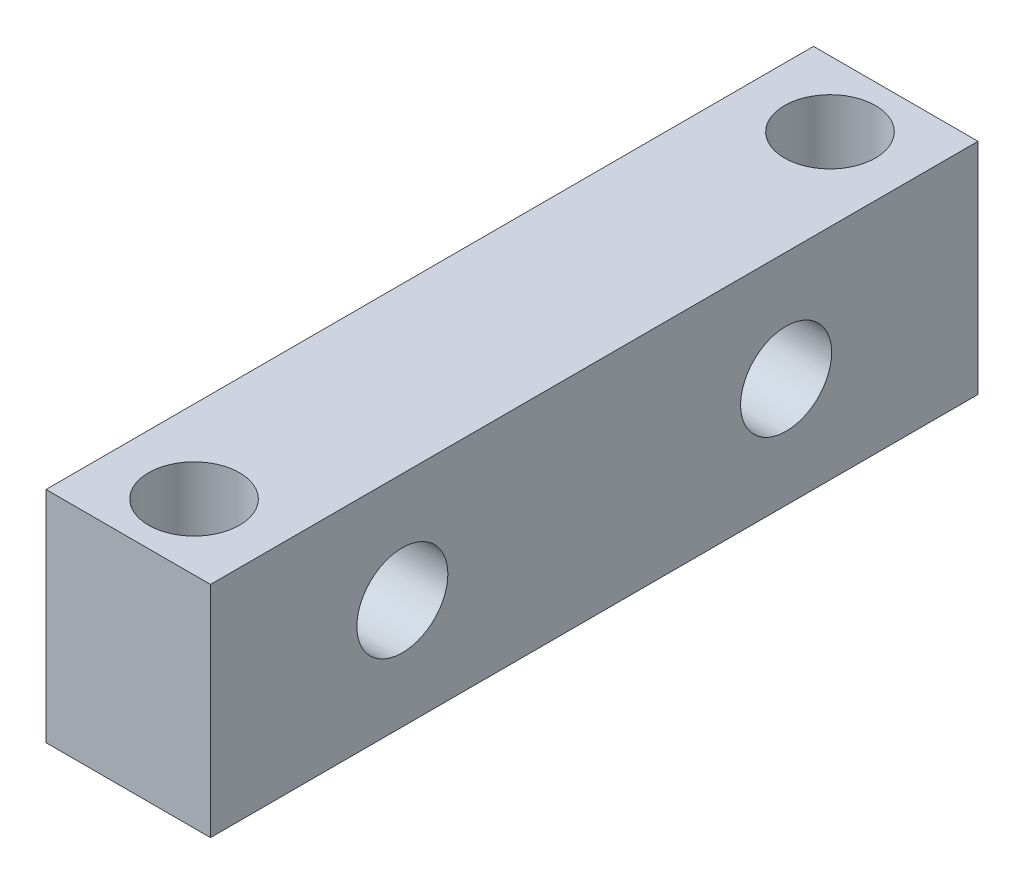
ISO-10303-21;
HEADER;
FILE_DESCRIPTION(('STEP AP214'),'2;1');
FILE_NAME('part.step','',(''),(''),'','','');
FILE_SCHEMA(('AUTOMOTIVE_DESIGN { 1 0 10303 214 1 1 1 1 }'));
ENDSEC;
DATA;
#1=APPLICATION_CONTEXT('core data for automotive mechanical design processes');
#2=APPLICATION_PROTOCOL_DEFINITION('international standard','automotive_design',2000,#1);
#3=PRODUCT_CONTEXT('',#1,'mechanical');
#4=PRODUCT('Part','Part','',(#3));
#5=PRODUCT_RELATED_PRODUCT_CATEGORY('part','',(#4));
#6=PRODUCT_DEFINITION_FORMATION('','',#4);
#7=PRODUCT_DEFINITION_CONTEXT('part definition',#1,'design');
#8=PRODUCT_DEFINITION('design','',#6,#7);
#9=PRODUCT_DEFINITION_SHAPE('','',#8);
#10=(LENGTH_UNIT() NAMED_UNIT(*) SI_UNIT(.MILLI.,.METRE.));
#11=(NAMED_UNIT(*) PLANE_ANGLE_UNIT() SI_UNIT($,.RADIAN.));
#12=(NAMED_UNIT(*) SI_UNIT($,.STERADIAN.) SOLID_ANGLE_UNIT());
#13=UNCERTAINTY_MEASURE_WITH_UNIT(LENGTH_MEASURE(1.E-05),#10,'distance_accuracy_value','');
#14=(GEOMETRIC_REPRESENTATION_CONTEXT(3) GLOBAL_UNCERTAINTY_ASSIGNED_CONTEXT((#13)) GLOBAL_UNIT_ASSIGNED_CONTEXT((#10,
#11,#12)) REPRESENTATION_CONTEXT('',''));
#15=CARTESIAN_POINT('',(0.,0.,0.));
#16=DIRECTION('',(0.,0.,1.));
#17=DIRECTION('',(1.,0.,0.));
#18=AXIS2_PLACEMENT_3D('',#15,#16,#17);
#19=CARTESIAN_POINT('',(15.,0.,0.));
#20=DIRECTION('',(0.,0.,-1.));
#21=DIRECTION('',(-1.,0.,0.));
#22=AXIS2_PLACEMENT_3D('',#19,#20,#21);
#23=PLANE('',#22);
#24=DIRECTION('',(0.,-1.,0.));
#25=VECTOR('',#24,1.);
#26=CARTESIAN_POINT('',(0.,0.,0.));
#27=LINE('',#26,#25);
#28=CARTESIAN_POINT('',(0.,20.,0.));
#29=VERTEX_POINT('',#28);
#30=CARTESIAN_POINT('',(0.,0.,0.));
#31=VERTEX_POINT('',#30);
#32=EDGE_CURVE('E96',#29,#31,#27,.T.);
#33=ORIENTED_EDGE('',*,*,#32,.T.);
#34=DIRECTION('',(-1.,0.,0.));
#35=VECTOR('',#34,1.);
#36=CARTESIAN_POINT('',(15.,0.,0.));
#37=LINE('',#36,#35);
#38=CARTESIAN_POINT('',(15.,0.,0.));
#39=VERTEX_POINT('',#38);
#40=EDGE_CURVE('E11',#39,#31,#37,.T.);
#41=ORIENTED_EDGE('',*,*,#40,.F.);
#42=DIRECTION('',(0.,-1.,0.));
#43=VECTOR('',#42,1.);
#44=CARTESIAN_POINT('',(15.,0.,0.));
#45=LINE('',#44,#43);
#46=CARTESIAN_POINT('',(15.,20.,0.));
#47=VERTEX_POINT('',#46);
#48=EDGE_CURVE('E84',#47,#39,#45,.T.);
#49=ORIENTED_EDGE('',*,*,#48,.F.);
#50=DIRECTION('',(-1.,0.,0.));
#51=VECTOR('',#50,1.);
#52=CARTESIAN_POINT('',(15.,20.,0.));
#53=LINE('',#52,#51);
#54=EDGE_CURVE('E92',#47,#29,#53,.T.);
#55=ORIENTED_EDGE('',*,*,#54,.T.);
#56=EDGE_LOOP('',(#33,#41,#49,#55));
#57=FACE_BOUND('',#56,.T.);
#58=ADVANCED_FACE('F33',(#57),#23,.F.);
#59=CARTESIAN_POINT('',(15.,0.,0.));
#60=DIRECTION('',(0.,1.,0.));
#61=DIRECTION('',(0.,0.,1.));
#62=AXIS2_PLACEMENT_3D('',#59,#60,#61);
#63=PLANE('',#62);
#64=CARTESIAN_POINT('',(7.5,0.,-6.));
#65=DIRECTION('',(0.,1.,0.));
#66=DIRECTION('',(0.,0.,1.));
#67=AXIS2_PLACEMENT_3D('',#64,#65,#66);
#68=CIRCLE('',#67,4.15);
#69=CARTESIAN_POINT('',(7.5,0.,-1.85));
#70=VERTEX_POINT('',#69);
#71=EDGE_CURVE('E114',#70,#70,#68,.T.);
#72=ORIENTED_EDGE('',*,*,#71,.T.);
#73=EDGE_LOOP('',(#72));
#74=FACE_BOUND('',#73,.T.);
#75=CARTESIAN_POINT('',(7.5,0.,-64.));
#76=DIRECTION('',(0.,1.,0.));
#77=DIRECTION('',(0.,0.,1.));
#78=AXIS2_PLACEMENT_3D('',#75,#76,#77);
#79=CIRCLE('',#78,4.15);
#80=CARTESIAN_POINT('',(7.5,0.,-59.85));
#81=VERTEX_POINT('',#80);
#82=EDGE_CURVE('E125',#81,#81,#79,.T.);
#83=ORIENTED_EDGE('',*,*,#82,.T.);
#84=EDGE_LOOP('',(#83));
#85=FACE_BOUND('',#84,.T.);
#86=DIRECTION('',(0.,0.,-1.));
#87=VECTOR('',#86,1.);
#88=CARTESIAN_POINT('',(0.,0.,0.));
#89=LINE('',#88,#87);
#90=CARTESIAN_POINT('',(0.,0.,-70.));
#91=VERTEX_POINT('',#90);
#92=EDGE_CURVE('E88',#31,#91,#89,.T.);
#93=ORIENTED_EDGE('',*,*,#92,.T.);
#94=DIRECTION('',(-1.,0.,0.));
#95=VECTOR('',#94,1.);
#96=CARTESIAN_POINT('',(15.,0.,-70.));
#97=LINE('',#96,#95);
#98=CARTESIAN_POINT('',(15.,0.,-70.));
#99=VERTEX_POINT('',#98);
#100=EDGE_CURVE('E41',#99,#91,#97,.T.);
#101=ORIENTED_EDGE('',*,*,#100,.F.);
#102=DIRECTION('',(0.,0.,-1.));
#103=VECTOR('',#102,1.);
#104=CARTESIAN_POINT('',(15.,0.,0.));
#105=LINE('',#104,#103);
#106=EDGE_CURVE('E79',#39,#99,#105,.T.);
#107=ORIENTED_EDGE('',*,*,#106,.F.);
#108=ORIENTED_EDGE('',*,*,#40,.T.);
#109=EDGE_LOOP('',(#93,#101,#107,#108));
#110=FACE_BOUND('',#109,.T.);
#111=ADVANCED_FACE('F87',(#74,#85,#110),#63,.F.);
#112=CARTESIAN_POINT('',(15.,0.,-70.));
#113=DIRECTION('',(0.,0.,1.));
#114=DIRECTION('',(1.,0.,0.));
#115=AXIS2_PLACEMENT_3D('',#112,#113,#114);
#116=PLANE('',#115);
#117=DIRECTION('',(0.,1.,0.));
#118=VECTOR('',#117,1.);
#119=CARTESIAN_POINT('',(0.,0.,-70.));
#120=LINE('',#119,#118);
#121=CARTESIAN_POINT('',(0.,20.,-70.));
#122=VERTEX_POINT('',#121);
#123=EDGE_CURVE('E66',#91,#122,#120,.T.);
#124=ORIENTED_EDGE('',*,*,#123,.T.);
#125=DIRECTION('',(-1.,0.,0.));
#126=VECTOR('',#125,1.);
#127=CARTESIAN_POINT('',(15.,20.,-70.));
#128=LINE('',#127,#126);
#129=CARTESIAN_POINT('',(15.,20.,-70.));
#130=VERTEX_POINT('',#129);
#131=EDGE_CURVE('E89',#130,#122,#128,.T.);
#132=ORIENTED_EDGE('',*,*,#131,.F.);
#133=DIRECTION('',(0.,1.,0.));
#134=VECTOR('',#133,1.);
#135=CARTESIAN_POINT('',(15.,0.,-70.));
#136=LINE('',#135,#134);
#137=EDGE_CURVE('E82',#99,#130,#136,.T.);
#138=ORIENTED_EDGE('',*,*,#137,.F.);
#139=ORIENTED_EDGE('',*,*,#100,.T.);
#140=EDGE_LOOP('',(#124,#132,#138,#139));
#141=FACE_BOUND('',#140,.T.);
#142=ADVANCED_FACE('F90',(#141),#116,.F.);
#143=CARTESIAN_POINT('',(15.,20.,0.));
#144=DIRECTION('',(0.,-1.,0.));
#145=DIRECTION('',(0.,0.,-1.));
#146=AXIS2_PLACEMENT_3D('',#143,#144,#145);
#147=PLANE('',#146);
#148=CARTESIAN_POINT('',(7.5,20.,-6.));
#149=DIRECTION('',(0.,1.,0.));
#150=DIRECTION('',(0.,0.,1.));
#151=AXIS2_PLACEMENT_3D('',#148,#149,#150);
#152=CIRCLE('',#151,4.15);
#153=CARTESIAN_POINT('',(7.5,20.,-1.85));
#154=VERTEX_POINT('',#153);
#155=EDGE_CURVE('E128',#154,#154,#152,.T.);
#156=ORIENTED_EDGE('',*,*,#155,.F.);
#157=EDGE_LOOP('',(#156));
#158=FACE_BOUND('',#157,.T.);
#159=CARTESIAN_POINT('',(7.5,20.,-64.));
#160=DIRECTION('',(0.,1.,0.));
#161=DIRECTION('',(0.,0.,1.));
#162=AXIS2_PLACEMENT_3D('',#159,#160,#161);
#163=CIRCLE('',#162,4.15);
#164=CARTESIAN_POINT('',(7.5,20.,-59.85));
#165=VERTEX_POINT('',#164);
#166=EDGE_CURVE('E122',#165,#165,#163,.T.);
#167=ORIENTED_EDGE('',*,*,#166,.F.);
#168=EDGE_LOOP('',(#167));
#169=FACE_BOUND('',#168,.T.);
#170=DIRECTION('',(0.,0.,1.));
#171=VECTOR('',#170,1.);
#172=CARTESIAN_POINT('',(0.,20.,0.));
#173=LINE('',#172,#171);
#174=EDGE_CURVE('E72',#122,#29,#173,.T.);
#175=ORIENTED_EDGE('',*,*,#174,.T.);
#176=ORIENTED_EDGE('',*,*,#54,.F.);
#177=DIRECTION('',(0.,0.,1.));
#178=VECTOR('',#177,1.);
#179=CARTESIAN_POINT('',(15.,20.,0.));
#180=LINE('',#179,#178);
#181=EDGE_CURVE('E49',#130,#47,#180,.T.);
#182=ORIENTED_EDGE('',*,*,#181,.F.);
#183=ORIENTED_EDGE('',*,*,#131,.T.);
#184=EDGE_LOOP('',(#175,#176,#182,#183));
#185=FACE_BOUND('',#184,.T.);
#186=ADVANCED_FACE('F104',(#158,#169,#185),#147,.F.);
#187=CARTESIAN_POINT('',(15.,0.,0.));
#188=DIRECTION('',(-1.,0.,0.));
#189=DIRECTION('',(0.,0.,1.));
#190=AXIS2_PLACEMENT_3D('',#187,#188,#189);
#191=PLANE('',#190);
#192=CARTESIAN_POINT('',(15.,10.,-17.5));
#193=DIRECTION('',(1.,0.,0.));
#194=DIRECTION('',(0.,0.,-1.));
#195=AXIS2_PLACEMENT_3D('',#192,#193,#194);
#196=CIRCLE('',#195,4.15);
#197=CARTESIAN_POINT('',(15.,10.,-21.65));
#198=VERTEX_POINT('',#197);
#199=EDGE_CURVE('E117',#198,#198,#196,.T.);
#200=ORIENTED_EDGE('',*,*,#199,.F.);
#201=EDGE_LOOP('',(#200));
#202=FACE_BOUND('',#201,.T.);
#203=CARTESIAN_POINT('',(15.,10.,-52.5));
#204=DIRECTION('',(1.,0.,0.));
#205=DIRECTION('',(0.,0.,-1.));
#206=AXIS2_PLACEMENT_3D('',#203,#204,#205);
#207=CIRCLE('',#206,4.15);
#208=CARTESIAN_POINT('',(15.,10.,-56.65));
#209=VERTEX_POINT('',#208);
#210=EDGE_CURVE('E110',#209,#209,#207,.T.);
#211=ORIENTED_EDGE('',*,*,#210,.F.);
#212=EDGE_LOOP('',(#211));
#213=FACE_BOUND('',#212,.T.);
#214=ORIENTED_EDGE('',*,*,#48,.T.);
#215=ORIENTED_EDGE('',*,*,#106,.T.);
#216=ORIENTED_EDGE('',*,*,#137,.T.);
#217=ORIENTED_EDGE('',*,*,#181,.T.);
#218=EDGE_LOOP('',(#214,#215,#216,#217));
#219=FACE_BOUND('',#218,.T.);
#220=ADVANCED_FACE('F80',(#202,#213,#219),#191,.F.);
#221=CARTESIAN_POINT('',(0.,0.,0.));
#222=DIRECTION('',(-1.,0.,0.));
#223=DIRECTION('',(0.,0.,1.));
#224=AXIS2_PLACEMENT_3D('',#221,#222,#223);
#225=PLANE('',#224);
#226=CARTESIAN_POINT('',(0.,10.,-17.5));
#227=DIRECTION('',(1.,0.,0.));
#228=DIRECTION('',(0.,0.,-1.));
#229=AXIS2_PLACEMENT_3D('',#226,#227,#228);
#230=CIRCLE('',#229,4.15);
#231=CARTESIAN_POINT('',(0.,10.,-21.65));
#232=VERTEX_POINT('',#231);
#233=EDGE_CURVE('E99',#232,#232,#230,.T.);
#234=ORIENTED_EDGE('',*,*,#233,.T.);
#235=EDGE_LOOP('',(#234));
#236=FACE_BOUND('',#235,.T.);
#237=CARTESIAN_POINT('',(0.,10.,-52.5));
#238=DIRECTION('',(1.,0.,0.));
#239=DIRECTION('',(0.,0.,-1.));
#240=AXIS2_PLACEMENT_3D('',#237,#238,#239);
#241=CIRCLE('',#240,4.15);
#242=CARTESIAN_POINT('',(0.,10.,-56.65));
#243=VERTEX_POINT('',#242);
#244=EDGE_CURVE('E113',#243,#243,#241,.T.);
#245=ORIENTED_EDGE('',*,*,#244,.T.);
#246=EDGE_LOOP('',(#245));
#247=FACE_BOUND('',#246,.T.);
#248=ORIENTED_EDGE('',*,*,#32,.F.);
#249=ORIENTED_EDGE('',*,*,#174,.F.);
#250=ORIENTED_EDGE('',*,*,#123,.F.);
#251=ORIENTED_EDGE('',*,*,#92,.F.);
#252=EDGE_LOOP('',(#248,#249,#250,#251));
#253=FACE_BOUND('',#252,.T.);
#254=ADVANCED_FACE('F107',(#236,#247,#253),#225,.T.);
#255=CARTESIAN_POINT('',(0.,10.,-52.5));
#256=DIRECTION('',(1.,0.,0.));
#257=DIRECTION('',(0.,0.,-1.));
#258=AXIS2_PLACEMENT_3D('',#255,#256,#257);
#259=CYLINDRICAL_SURFACE('',#258,4.15);
#260=ORIENTED_EDGE('',*,*,#244,.F.);
#261=EDGE_LOOP('',(#260));
#262=FACE_BOUND('',#261,.T.);
#263=ORIENTED_EDGE('',*,*,#210,.T.);
#264=EDGE_LOOP('',(#263));
#265=FACE_BOUND('',#264,.T.);
#266=ADVANCED_FACE('F155',(#262,#265),#259,.F.);
#267=CARTESIAN_POINT('',(0.,10.,-17.5));
#268=DIRECTION('',(1.,0.,0.));
#269=DIRECTION('',(0.,0.,-1.));
#270=AXIS2_PLACEMENT_3D('',#267,#268,#269);
#271=CYLINDRICAL_SURFACE('',#270,4.15);
#272=ORIENTED_EDGE('',*,*,#233,.F.);
#273=EDGE_LOOP('',(#272));
#274=FACE_BOUND('',#273,.T.);
#275=ORIENTED_EDGE('',*,*,#199,.T.);
#276=EDGE_LOOP('',(#275));
#277=FACE_BOUND('',#276,.T.);
#278=ADVANCED_FACE('F149',(#274,#277),#271,.F.);
#279=CARTESIAN_POINT('',(7.5,0.,-64.));
#280=DIRECTION('',(0.,1.,0.));
#281=DIRECTION('',(0.,0.,1.));
#282=AXIS2_PLACEMENT_3D('',#279,#280,#281);
#283=CYLINDRICAL_SURFACE('',#282,4.15);
#284=ORIENTED_EDGE('',*,*,#82,.F.);
#285=EDGE_LOOP('',(#284));
#286=FACE_BOUND('',#285,.T.);
#287=ORIENTED_EDGE('',*,*,#166,.T.);
#288=EDGE_LOOP('',(#287));
#289=FACE_BOUND('',#288,.T.);
#290=ADVANCED_FACE('F139',(#286,#289),#283,.F.);
#291=CARTESIAN_POINT('',(7.5,0.,-6.));
#292=DIRECTION('',(0.,1.,0.));
#293=DIRECTION('',(0.,0.,1.));
#294=AXIS2_PLACEMENT_3D('',#291,#292,#293);
#295=CYLINDRICAL_SURFACE('',#294,4.15);
#296=ORIENTED_EDGE('',*,*,#71,.F.);
#297=EDGE_LOOP('',(#296));
#298=FACE_BOUND('',#297,.T.);
#299=ORIENTED_EDGE('',*,*,#155,.T.);
#300=EDGE_LOOP('',(#299));
#301=FACE_BOUND('',#300,.T.);
#302=ADVANCED_FACE('F136',(#298,#301),#295,.F.);
#303=CLOSED_SHELL('',(#58,#111,#142,#186,#220,#254,#266,#278,#290,#302));
#304=MANIFOLD_SOLID_BREP('B2',#303);
#305=ADVANCED_BREP_SHAPE_REPRESENTATION('',(#18,#304),#14);
#306=SHAPE_DEFINITION_REPRESENTATION(#9,#305);
ENDSEC;
END-ISO-10303-21;
